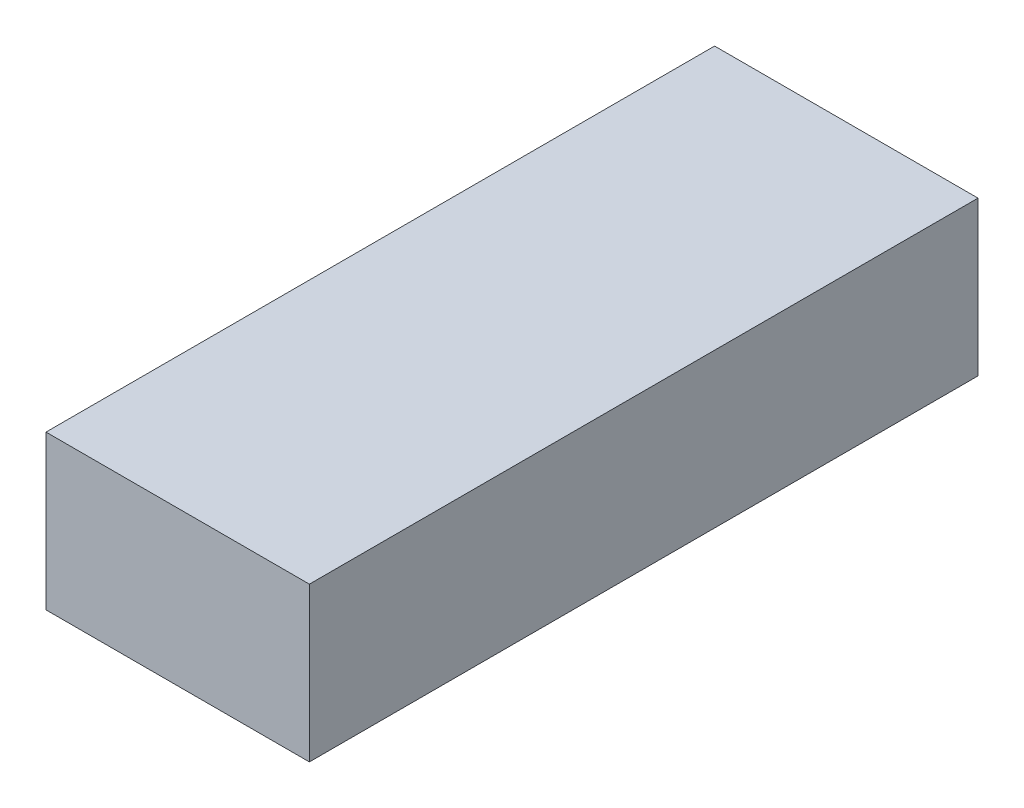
ISO-10303-21;
HEADER;
FILE_DESCRIPTION(('STEP AP214'),'2;1');
FILE_NAME('part.step','',(''),(''),'','','');
FILE_SCHEMA(('AUTOMOTIVE_DESIGN { 1 0 10303 214 1 1 1 1 }'));
ENDSEC;
DATA;
#1=APPLICATION_CONTEXT('core data for automotive mechanical design processes');
#2=APPLICATION_PROTOCOL_DEFINITION('international standard','automotive_design',2000,#1);
#3=PRODUCT_CONTEXT('',#1,'mechanical');
#4=PRODUCT('Part','Part','',(#3));
#5=PRODUCT_RELATED_PRODUCT_CATEGORY('part','',(#4));
#6=PRODUCT_DEFINITION_FORMATION('','',#4);
#7=PRODUCT_DEFINITION_CONTEXT('part definition',#1,'design');
#8=PRODUCT_DEFINITION('design','',#6,#7);
#9=PRODUCT_DEFINITION_SHAPE('','',#8);
#10=(LENGTH_UNIT() NAMED_UNIT(*) SI_UNIT(.MILLI.,.METRE.));
#11=(NAMED_UNIT(*) PLANE_ANGLE_UNIT() SI_UNIT($,.RADIAN.));
#12=(NAMED_UNIT(*) SI_UNIT($,.STERADIAN.) SOLID_ANGLE_UNIT());
#13=UNCERTAINTY_MEASURE_WITH_UNIT(LENGTH_MEASURE(1.E-05),#10,'distance_accuracy_value','');
#14=(GEOMETRIC_REPRESENTATION_CONTEXT(3) GLOBAL_UNCERTAINTY_ASSIGNED_CONTEXT((#13)) GLOBAL_UNIT_ASSIGNED_CONTEXT((#10,
#11,#12)) REPRESENTATION_CONTEXT('',''));
#15=CARTESIAN_POINT('',(0.,0.,0.));
#16=DIRECTION('',(0.,0.,1.));
#17=DIRECTION('',(1.,0.,0.));
#18=AXIS2_PLACEMENT_3D('',#15,#16,#17);
#19=CARTESIAN_POINT('',(0.,0.,165.));
#20=DIRECTION('',(-1.,0.,0.));
#21=DIRECTION('',(0.,0.,1.));
#22=AXIS2_PLACEMENT_3D('',#19,#20,#21);
#23=PLANE('',#22);
#24=DIRECTION('',(0.,1.,0.));
#25=VECTOR('',#24,1.);
#26=CARTESIAN_POINT('',(0.,0.,0.));
#27=LINE('',#26,#25);
#28=CARTESIAN_POINT('',(0.,0.,0.));
#29=VERTEX_POINT('',#28);
#30=CARTESIAN_POINT('',(0.,38.,0.));
#31=VERTEX_POINT('',#30);
#32=EDGE_CURVE('E100',#29,#31,#27,.T.);
#33=ORIENTED_EDGE('',*,*,#32,.T.);
#34=DIRECTION('',(0.,0.,-1.));
#35=VECTOR('',#34,1.);
#36=CARTESIAN_POINT('',(0.,38.,165.));
#37=LINE('',#36,#35);
#38=CARTESIAN_POINT('',(0.,38.,165.));
#39=VERTEX_POINT('',#38);
#40=EDGE_CURVE('E11',#39,#31,#37,.T.);
#41=ORIENTED_EDGE('',*,*,#40,.F.);
#42=DIRECTION('',(0.,1.,0.));
#43=VECTOR('',#42,1.);
#44=CARTESIAN_POINT('',(0.,0.,165.));
#45=LINE('',#44,#43);
#46=CARTESIAN_POINT('',(0.,0.,165.));
#47=VERTEX_POINT('',#46);
#48=EDGE_CURVE('E88',#47,#39,#45,.T.);
#49=ORIENTED_EDGE('',*,*,#48,.F.);
#50=DIRECTION('',(0.,0.,-1.));
#51=VECTOR('',#50,1.);
#52=CARTESIAN_POINT('',(0.,0.,165.));
#53=LINE('',#52,#51);
#54=EDGE_CURVE('E96',#47,#29,#53,.T.);
#55=ORIENTED_EDGE('',*,*,#54,.T.);
#56=EDGE_LOOP('',(#33,#41,#49,#55));
#57=FACE_BOUND('',#56,.T.);
#58=ADVANCED_FACE('F37',(#57),#23,.F.);
#59=CARTESIAN_POINT('',(0.,38.,165.));
#60=DIRECTION('',(0.,-1.,0.));
#61=DIRECTION('',(1.,0.,0.));
#62=AXIS2_PLACEMENT_3D('',#59,#60,#61);
#63=PLANE('',#62);
#64=DIRECTION('',(-1.,0.,0.));
#65=VECTOR('',#64,1.);
#66=CARTESIAN_POINT('',(0.,38.,0.));
#67=LINE('',#66,#65);
#68=CARTESIAN_POINT('',(-65.,38.,0.));
#69=VERTEX_POINT('',#68);
#70=EDGE_CURVE('E92',#31,#69,#67,.T.);
#71=ORIENTED_EDGE('',*,*,#70,.T.);
#72=DIRECTION('',(0.,0.,-1.));
#73=VECTOR('',#72,1.);
#74=CARTESIAN_POINT('',(-65.,38.,165.));
#75=LINE('',#74,#73);
#76=CARTESIAN_POINT('',(-65.,38.,165.));
#77=VERTEX_POINT('',#76);
#78=EDGE_CURVE('E45',#77,#69,#75,.T.);
#79=ORIENTED_EDGE('',*,*,#78,.F.);
#80=DIRECTION('',(-1.,0.,0.));
#81=VECTOR('',#80,1.);
#82=CARTESIAN_POINT('',(0.,38.,165.));
#83=LINE('',#82,#81);
#84=EDGE_CURVE('E83',#39,#77,#83,.T.);
#85=ORIENTED_EDGE('',*,*,#84,.F.);
#86=ORIENTED_EDGE('',*,*,#40,.T.);
#87=EDGE_LOOP('',(#71,#79,#85,#86));
#88=FACE_BOUND('',#87,.T.);
#89=ADVANCED_FACE('F91',(#88),#63,.F.);
#90=CARTESIAN_POINT('',(-65.,0.,165.));
#91=DIRECTION('',(1.,0.,0.));
#92=DIRECTION('',(0.,0.,-1.));
#93=AXIS2_PLACEMENT_3D('',#90,#91,#92);
#94=PLANE('',#93);
#95=DIRECTION('',(0.,-1.,0.));
#96=VECTOR('',#95,1.);
#97=CARTESIAN_POINT('',(-65.,0.,0.));
#98=LINE('',#97,#96);
#99=CARTESIAN_POINT('',(-65.,0.,0.));
#100=VERTEX_POINT('',#99);
#101=EDGE_CURVE('E70',#69,#100,#98,.T.);
#102=ORIENTED_EDGE('',*,*,#101,.T.);
#103=DIRECTION('',(0.,0.,-1.));
#104=VECTOR('',#103,1.);
#105=CARTESIAN_POINT('',(-65.,0.,165.));
#106=LINE('',#105,#104);
#107=CARTESIAN_POINT('',(-65.,0.,165.));
#108=VERTEX_POINT('',#107);
#109=EDGE_CURVE('E93',#108,#100,#106,.T.);
#110=ORIENTED_EDGE('',*,*,#109,.F.);
#111=DIRECTION('',(0.,-1.,0.));
#112=VECTOR('',#111,1.);
#113=CARTESIAN_POINT('',(-65.,0.,165.));
#114=LINE('',#113,#112);
#115=EDGE_CURVE('E86',#77,#108,#114,.T.);
#116=ORIENTED_EDGE('',*,*,#115,.F.);
#117=ORIENTED_EDGE('',*,*,#78,.T.);
#118=EDGE_LOOP('',(#102,#110,#116,#117));
#119=FACE_BOUND('',#118,.T.);
#120=ADVANCED_FACE('F94',(#119),#94,.F.);
#121=CARTESIAN_POINT('',(0.,0.,165.));
#122=DIRECTION('',(0.,1.,0.));
#123=DIRECTION('',(-1.,0.,0.));
#124=AXIS2_PLACEMENT_3D('',#121,#122,#123);
#125=PLANE('',#124);
#126=DIRECTION('',(1.,0.,0.));
#127=VECTOR('',#126,1.);
#128=CARTESIAN_POINT('',(0.,0.,0.));
#129=LINE('',#128,#127);
#130=EDGE_CURVE('E76',#100,#29,#129,.T.);
#131=ORIENTED_EDGE('',*,*,#130,.T.);
#132=ORIENTED_EDGE('',*,*,#54,.F.);
#133=DIRECTION('',(1.,0.,0.));
#134=VECTOR('',#133,1.);
#135=CARTESIAN_POINT('',(0.,0.,165.));
#136=LINE('',#135,#134);
#137=EDGE_CURVE('E53',#108,#47,#136,.T.);
#138=ORIENTED_EDGE('',*,*,#137,.F.);
#139=ORIENTED_EDGE('',*,*,#109,.T.);
#140=EDGE_LOOP('',(#131,#132,#138,#139));
#141=FACE_BOUND('',#140,.T.);
#142=ADVANCED_FACE('F107',(#141),#125,.F.);
#143=CARTESIAN_POINT('',(0.,0.,165.));
#144=DIRECTION('',(0.,0.,1.));
#145=DIRECTION('',(1.,0.,0.));
#146=AXIS2_PLACEMENT_3D('',#143,#144,#145);
#147=PLANE('',#146);
#148=ORIENTED_EDGE('',*,*,#48,.T.);
#149=ORIENTED_EDGE('',*,*,#84,.T.);
#150=ORIENTED_EDGE('',*,*,#115,.T.);
#151=ORIENTED_EDGE('',*,*,#137,.T.);
#152=EDGE_LOOP('',(#148,#149,#150,#151));
#153=FACE_BOUND('',#152,.T.);
#154=ADVANCED_FACE('F84',(#153),#147,.T.);
#155=CARTESIAN_POINT('',(0.,0.,0.));
#156=DIRECTION('',(0.,0.,1.));
#157=DIRECTION('',(1.,0.,0.));
#158=AXIS2_PLACEMENT_3D('',#155,#156,#157);
#159=PLANE('',#158);
#160=ORIENTED_EDGE('',*,*,#32,.F.);
#161=ORIENTED_EDGE('',*,*,#130,.F.);
#162=ORIENTED_EDGE('',*,*,#101,.F.);
#163=ORIENTED_EDGE('',*,*,#70,.F.);
#164=EDGE_LOOP('',(#160,#161,#162,#163));
#165=FACE_BOUND('',#164,.T.);
#166=ADVANCED_FACE('F110',(#165),#159,.F.);
#167=CLOSED_SHELL('',(#58,#89,#120,#142,#154,#166));
#168=MANIFOLD_SOLID_BREP('B2',#167);
#169=ADVANCED_BREP_SHAPE_REPRESENTATION('',(#18,#168),#14);
#170=SHAPE_DEFINITION_REPRESENTATION(#9,#169);
ENDSEC;
END-ISO-10303-21;
